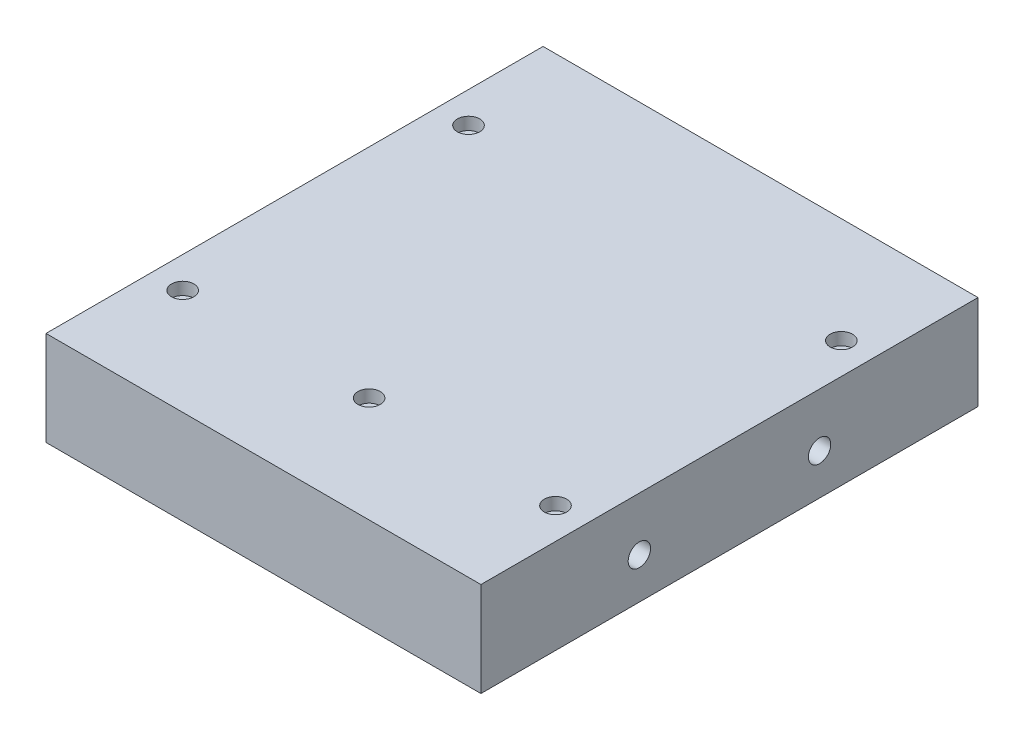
from build123d import *

# Parameters (mm, degrees)
SKETCH1_W           = 44.45
SKETCH1_H           = 50.8
BOSS_EXTRUDE1_DEPTH = 9.652
SKETCH2_R           = 1.143
CUT_EXTRUDE1_DEPTH  = 1.27
SKETCH3_R           = 1.143
CUT_EXTRUDE2_DEPTH  = 10.16
CUT_EXTRUDE3_START  = -10.16
SKETCH4_R           = 1.143
CUT_EXTRUDE3_DEPTH  = 10.16


with BuildPart() as part:
    # Sketch1 → Boss-Extrude1 (new body)
    with BuildSketch(Plane(origin=(0, 0, 0), x_dir=(1, 0, 0), z_dir=(0, 1, 0))):
        Rectangle(SKETCH1_W, SKETCH1_H)
    extrude(amount=BOSS_EXTRUDE1_DEPTH)

    # Sketch2 → Cut-Extrude1 (cut)
    with BuildSketch(Plane(origin=(0, 9.652, 0), x_dir=(1, 0, 0), z_dir=(0, 1, 0))):
        with Locations(Location((0, -14.605, 0), (0, 0, 270))):
            Circle(SKETCH2_R)
        with Locations(Location((-19.05, -14.605, 0), (0, 0, 270))):
            Circle(SKETCH2_R)
        with Locations(Location((19.05, -14.605, 0), (0, 0, 270))):
            Circle(SKETCH2_R)
        with Locations(Location((-19.05, 14.605, 0), (0, 0, 270))):
            Circle(SKETCH2_R)
        with Locations(Location((19.05, 14.605, 0), (0, 0, 270))):
            Circle(SKETCH2_R)
    extrude(amount=-CUT_EXTRUDE1_DEPTH, mode=Mode.SUBTRACT)

    # Sketch3 → Cut-Extrude2 (cut)
    with BuildSketch(Plane.ZY.offset(22.225)):
        with Locations((-9.2075, 4.191)):
            Circle(SKETCH3_R)
        with Locations((9.2075, 4.191)):
            Circle(SKETCH3_R)
    extrude(amount=-CUT_EXTRUDE2_DEPTH, mode=Mode.SUBTRACT)

    # Sketch4 → Cut-Extrude3 (cut)
    with BuildSketch(Plane(origin=(22.225, 0, 0), x_dir=(0, 0, -1), z_dir=(1, 0, 0)).offset(CUT_EXTRUDE3_START)):
        with Locations(Location((-9.2075, 4.191, 0), (0, 0, 180))):
            Circle(SKETCH4_R)
        with Locations(Location((9.2075, 4.191, 0), (0, 0, 180))):
            Circle(SKETCH4_R)
    extrude(amount=CUT_EXTRUDE3_DEPTH, mode=Mode.SUBTRACT)


solid = part.part
